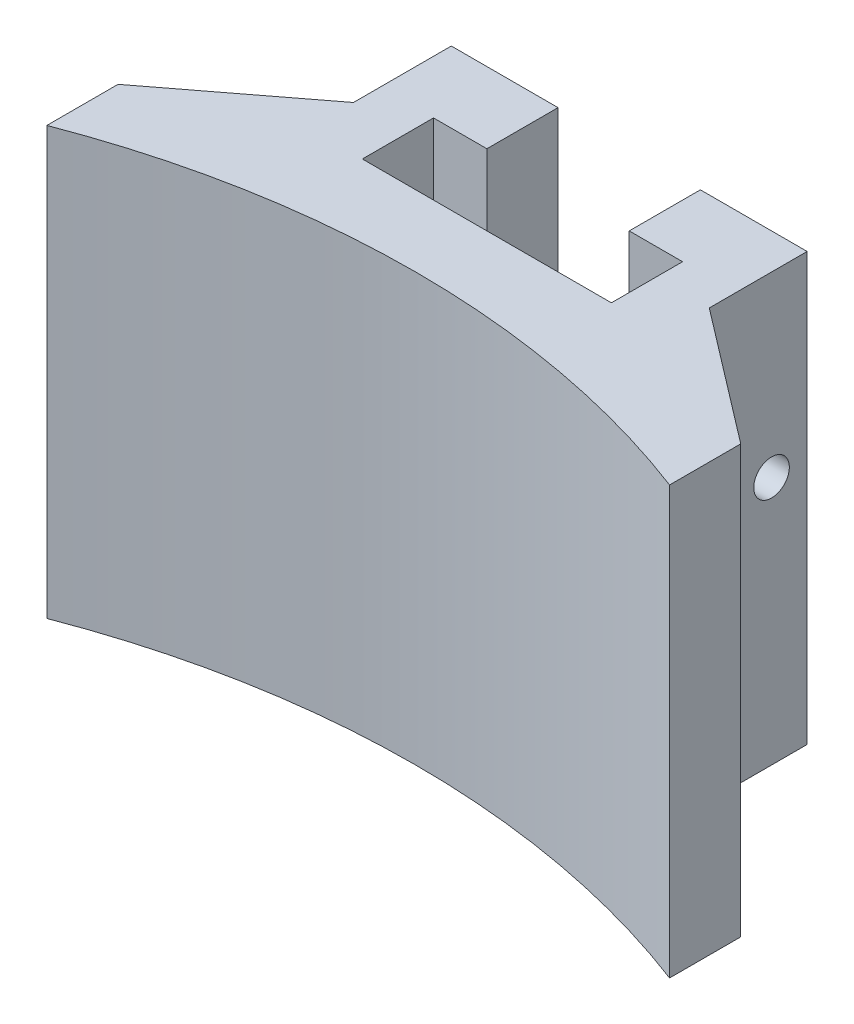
ISO-10303-21;
HEADER;
FILE_DESCRIPTION(('STEP AP214'),'2;1');
FILE_NAME('part.step','',(''),(''),'','','');
FILE_SCHEMA(('AUTOMOTIVE_DESIGN { 1 0 10303 214 1 1 1 1 }'));
ENDSEC;
DATA;
#1=APPLICATION_CONTEXT('core data for automotive mechanical design processes');
#2=APPLICATION_PROTOCOL_DEFINITION('international standard','automotive_design',2000,#1);
#3=PRODUCT_CONTEXT('',#1,'mechanical');
#4=PRODUCT('Part','Part','',(#3));
#5=PRODUCT_RELATED_PRODUCT_CATEGORY('part','',(#4));
#6=PRODUCT_DEFINITION_FORMATION('','',#4);
#7=PRODUCT_DEFINITION_CONTEXT('part definition',#1,'design');
#8=PRODUCT_DEFINITION('design','',#6,#7);
#9=PRODUCT_DEFINITION_SHAPE('','',#8);
#10=(LENGTH_UNIT() NAMED_UNIT(*) SI_UNIT(.MILLI.,.METRE.));
#11=(NAMED_UNIT(*) PLANE_ANGLE_UNIT() SI_UNIT($,.RADIAN.));
#12=(NAMED_UNIT(*) SI_UNIT($,.STERADIAN.) SOLID_ANGLE_UNIT());
#13=UNCERTAINTY_MEASURE_WITH_UNIT(LENGTH_MEASURE(1.E-05),#10,'distance_accuracy_value','');
#14=(GEOMETRIC_REPRESENTATION_CONTEXT(3) GLOBAL_UNCERTAINTY_ASSIGNED_CONTEXT((#13)) GLOBAL_UNIT_ASSIGNED_CONTEXT((#10,
#11,#12)) REPRESENTATION_CONTEXT('',''));
#15=CARTESIAN_POINT('',(0.,0.,0.));
#16=DIRECTION('',(0.,0.,1.));
#17=DIRECTION('',(1.,0.,0.));
#18=AXIS2_PLACEMENT_3D('',#15,#16,#17);
#19=CARTESIAN_POINT('',(-10.,-12.,11.));
#20=DIRECTION('',(-1.,0.,0.));
#21=DIRECTION('',(0.,0.,1.));
#22=AXIS2_PLACEMENT_3D('',#19,#20,#21);
#23=PLANE('',#22);
#24=DIRECTION('',(0.,-1.,0.));
#25=VECTOR('',#24,1.);
#26=CARTESIAN_POINT('',(-10.,48.3277205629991,5.5));
#27=LINE('',#26,#25);
#28=CARTESIAN_POINT('',(-10.,12.,5.5));
#29=VERTEX_POINT('',#28);
#30=CARTESIAN_POINT('',(-10.,-12.,5.5));
#31=VERTEX_POINT('',#30);
#32=EDGE_CURVE('E154',#29,#31,#27,.T.);
#33=ORIENTED_EDGE('',*,*,#32,.F.);
#34=DIRECTION('',(0.,0.,-1.));
#35=VECTOR('',#34,1.);
#36=CARTESIAN_POINT('',(-10.,12.,11.));
#37=LINE('',#36,#35);
#38=CARTESIAN_POINT('',(-10.,12.,0.));
#39=VERTEX_POINT('',#38);
#40=EDGE_CURVE('E152',#29,#39,#37,.T.);
#41=ORIENTED_EDGE('',*,*,#40,.T.);
#42=DIRECTION('',(0.,1.,0.));
#43=VECTOR('',#42,1.);
#44=CARTESIAN_POINT('',(-10.,-12.,0.));
#45=LINE('',#44,#43);
#46=CARTESIAN_POINT('',(-10.,-12.,0.));
#47=VERTEX_POINT('',#46);
#48=EDGE_CURVE('E247',#47,#39,#45,.T.);
#49=ORIENTED_EDGE('',*,*,#48,.F.);
#50=DIRECTION('',(0.,0.,-1.));
#51=VECTOR('',#50,1.);
#52=CARTESIAN_POINT('',(-10.,-12.,11.));
#53=LINE('',#52,#51);
#54=EDGE_CURVE('E11',#31,#47,#53,.T.);
#55=ORIENTED_EDGE('',*,*,#54,.F.);
#56=EDGE_LOOP('',(#33,#41,#49,#55));
#57=FACE_BOUND('',#56,.T.);
#58=CARTESIAN_POINT('',(-10.,2.,2.));
#59=DIRECTION('',(-1.,0.,0.));
#60=DIRECTION('',(0.,0.,1.));
#61=AXIS2_PLACEMENT_3D('',#58,#59,#60);
#62=CIRCLE('',#61,1.);
#63=CARTESIAN_POINT('',(-10.,2.,3.));
#64=VERTEX_POINT('',#63);
#65=EDGE_CURVE('E192',#64,#64,#62,.T.);
#66=ORIENTED_EDGE('',*,*,#65,.F.);
#67=EDGE_LOOP('',(#66));
#68=FACE_BOUND('',#67,.T.);
#69=ADVANCED_FACE('F33',(#57,#68),#23,.T.);
#70=CARTESIAN_POINT('',(-10.,-12.,11.));
#71=DIRECTION('',(0.,1.,0.));
#72=DIRECTION('',(0.,0.,1.));
#73=AXIS2_PLACEMENT_3D('',#70,#71,#72);
#74=PLANE('',#73);
#75=DIRECTION('',(0.794548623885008,0.,-0.607200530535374));
#76=VECTOR('',#75,1.);
#77=CARTESIAN_POINT('',(-17.5,-12.,11.2315610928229));
#78=LINE('',#77,#76);
#79=CARTESIAN_POINT('',(-17.5,-12.,11.2315610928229));
#80=VERTEX_POINT('',#79);
#81=EDGE_CURVE('E160',#80,#31,#78,.T.);
#82=ORIENTED_EDGE('',*,*,#81,.T.);
#83=ORIENTED_EDGE('',*,*,#54,.T.);
#84=DIRECTION('',(1.,0.,0.));
#85=VECTOR('',#84,1.);
#86=CARTESIAN_POINT('',(-10.,-12.,0.));
#87=LINE('',#86,#85);
#88=CARTESIAN_POINT('',(10.,-12.,0.));
#89=VERTEX_POINT('',#88);
#90=EDGE_CURVE('E271',#47,#89,#87,.T.);
#91=ORIENTED_EDGE('',*,*,#90,.T.);
#92=DIRECTION('',(0.,0.,-1.));
#93=VECTOR('',#92,1.);
#94=CARTESIAN_POINT('',(10.,-12.,11.));
#95=LINE('',#94,#93);
#96=CARTESIAN_POINT('',(10.,-12.,5.5));
#97=VERTEX_POINT('',#96);
#98=EDGE_CURVE('E41',#97,#89,#95,.T.);
#99=ORIENTED_EDGE('',*,*,#98,.F.);
#100=DIRECTION('',(0.794548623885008,0.,0.607200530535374));
#101=VECTOR('',#100,1.);
#102=CARTESIAN_POINT('',(17.5,-12.,11.2315610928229));
#103=LINE('',#102,#101);
#104=CARTESIAN_POINT('',(17.5,-12.,11.2315610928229));
#105=VERTEX_POINT('',#104);
#106=EDGE_CURVE('E171',#97,#105,#103,.T.);
#107=ORIENTED_EDGE('',*,*,#106,.T.);
#108=DIRECTION('',(0.,0.,1.));
#109=VECTOR('',#108,1.);
#110=CARTESIAN_POINT('',(17.5,-12.,15.2315610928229));
#111=LINE('',#110,#109);
#112=CARTESIAN_POINT('',(17.5,-12.,15.2315610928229));
#113=VERTEX_POINT('',#112);
#114=EDGE_CURVE('E168',#105,#113,#111,.T.);
#115=ORIENTED_EDGE('',*,*,#114,.T.);
#116=CARTESIAN_POINT('',(0.,-12.,61.));
#117=DIRECTION('',(0.,1.,0.));
#118=DIRECTION('',(0.,0.,-1.));
#119=AXIS2_PLACEMENT_3D('',#116,#117,#118);
#120=CIRCLE('',#119,49.);
#121=CARTESIAN_POINT('',(-17.5,-12.,15.2315610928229));
#122=VERTEX_POINT('',#121);
#123=EDGE_CURVE('E175',#113,#122,#120,.T.);
#124=ORIENTED_EDGE('',*,*,#123,.T.);
#125=DIRECTION('',(0.,0.,-1.));
#126=VECTOR('',#125,1.);
#127=CARTESIAN_POINT('',(-17.5,-12.,15.2315610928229));
#128=LINE('',#127,#126);
#129=EDGE_CURVE('E290',#122,#80,#128,.T.);
#130=ORIENTED_EDGE('',*,*,#129,.T.);
#131=EDGE_LOOP('',(#82,#83,#91,#99,#107,#115,#124,#130));
#132=FACE_BOUND('',#131,.T.);
#133=ADVANCED_FACE('F286',(#132),#74,.F.);
#134=CARTESIAN_POINT('',(10.,-12.,11.));
#135=DIRECTION('',(-1.,0.,0.));
#136=DIRECTION('',(0.,0.,1.));
#137=AXIS2_PLACEMENT_3D('',#134,#135,#136);
#138=PLANE('',#137);
#139=CARTESIAN_POINT('',(10.,2.,2.));
#140=DIRECTION('',(-1.,0.,0.));
#141=DIRECTION('',(0.,0.,1.));
#142=AXIS2_PLACEMENT_3D('',#139,#140,#141);
#143=CIRCLE('',#142,1.);
#144=CARTESIAN_POINT('',(10.,2.,3.));
#145=VERTEX_POINT('',#144);
#146=EDGE_CURVE('E193',#145,#145,#143,.T.);
#147=ORIENTED_EDGE('',*,*,#146,.T.);
#148=EDGE_LOOP('',(#147));
#149=FACE_BOUND('',#148,.T.);
#150=DIRECTION('',(0.,0.,-1.));
#151=VECTOR('',#150,1.);
#152=CARTESIAN_POINT('',(10.,12.,11.));
#153=LINE('',#152,#151);
#154=CARTESIAN_POINT('',(10.,12.,5.5));
#155=VERTEX_POINT('',#154);
#156=CARTESIAN_POINT('',(10.,12.,0.));
#157=VERTEX_POINT('',#156);
#158=EDGE_CURVE('E275',#155,#157,#153,.T.);
#159=ORIENTED_EDGE('',*,*,#158,.F.);
#160=DIRECTION('',(0.,-1.,0.));
#161=VECTOR('',#160,1.);
#162=CARTESIAN_POINT('',(10.,48.3277205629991,5.5));
#163=LINE('',#162,#161);
#164=EDGE_CURVE('E55',#155,#97,#163,.T.);
#165=ORIENTED_EDGE('',*,*,#164,.T.);
#166=ORIENTED_EDGE('',*,*,#98,.T.);
#167=DIRECTION('',(0.,1.,0.));
#168=VECTOR('',#167,1.);
#169=CARTESIAN_POINT('',(10.,-12.,0.));
#170=LINE('',#169,#168);
#171=EDGE_CURVE('E268',#89,#157,#170,.T.);
#172=ORIENTED_EDGE('',*,*,#171,.T.);
#173=EDGE_LOOP('',(#159,#165,#166,#172));
#174=FACE_BOUND('',#173,.T.);
#175=ADVANCED_FACE('F318',(#149,#174),#138,.F.);
#176=CARTESIAN_POINT('',(-10.,12.,11.));
#177=DIRECTION('',(0.,1.,0.));
#178=DIRECTION('',(0.,0.,1.));
#179=AXIS2_PLACEMENT_3D('',#176,#177,#178);
#180=PLANE('',#179);
#181=ORIENTED_EDGE('',*,*,#40,.F.);
#182=DIRECTION('',(0.794548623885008,0.,-0.607200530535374));
#183=VECTOR('',#182,1.);
#184=CARTESIAN_POINT('',(-17.5,12.,11.2315610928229));
#185=LINE('',#184,#183);
#186=CARTESIAN_POINT('',(-17.5,12.,11.2315610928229));
#187=VERTEX_POINT('',#186);
#188=EDGE_CURVE('E145',#187,#29,#185,.T.);
#189=ORIENTED_EDGE('',*,*,#188,.F.);
#190=DIRECTION('',(0.,0.,-1.));
#191=VECTOR('',#190,1.);
#192=CARTESIAN_POINT('',(-17.5,12.,15.2315610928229));
#193=LINE('',#192,#191);
#194=CARTESIAN_POINT('',(-17.5,12.,15.2315610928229));
#195=VERTEX_POINT('',#194);
#196=EDGE_CURVE('E149',#195,#187,#193,.T.);
#197=ORIENTED_EDGE('',*,*,#196,.F.);
#198=CARTESIAN_POINT('',(0.,12.,61.));
#199=DIRECTION('',(0.,1.,0.));
#200=DIRECTION('',(0.,0.,1.));
#201=AXIS2_PLACEMENT_3D('',#198,#199,#200);
#202=CIRCLE('',#201,49.);
#203=CARTESIAN_POINT('',(17.5,12.,15.2315610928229));
#204=VERTEX_POINT('',#203);
#205=EDGE_CURVE('E177',#204,#195,#202,.T.);
#206=ORIENTED_EDGE('',*,*,#205,.F.);
#207=DIRECTION('',(0.,0.,1.));
#208=VECTOR('',#207,1.);
#209=CARTESIAN_POINT('',(17.5,12.,15.2315610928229));
#210=LINE('',#209,#208);
#211=CARTESIAN_POINT('',(17.5,12.,11.2315610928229));
#212=VERTEX_POINT('',#211);
#213=EDGE_CURVE('E180',#212,#204,#210,.T.);
#214=ORIENTED_EDGE('',*,*,#213,.F.);
#215=DIRECTION('',(0.794548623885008,0.,0.607200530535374));
#216=VECTOR('',#215,1.);
#217=CARTESIAN_POINT('',(17.5,12.,11.2315610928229));
#218=LINE('',#217,#216);
#219=EDGE_CURVE('E184',#155,#212,#218,.T.);
#220=ORIENTED_EDGE('',*,*,#219,.F.);
#221=ORIENTED_EDGE('',*,*,#158,.T.);
#222=DIRECTION('',(1.,0.,0.));
#223=VECTOR('',#222,1.);
#224=CARTESIAN_POINT('',(-10.,12.,0.));
#225=LINE('',#224,#223);
#226=CARTESIAN_POINT('',(4.,12.,0.));
#227=VERTEX_POINT('',#226);
#228=EDGE_CURVE('E264',#227,#157,#225,.T.);
#229=ORIENTED_EDGE('',*,*,#228,.F.);
#230=DIRECTION('',(0.,0.,-1.));
#231=VECTOR('',#230,1.);
#232=CARTESIAN_POINT('',(4.,12.,0.));
#233=LINE('',#232,#231);
#234=CARTESIAN_POINT('',(4.,12.,4.));
#235=VERTEX_POINT('',#234);
#236=EDGE_CURVE('E201',#235,#227,#233,.T.);
#237=ORIENTED_EDGE('',*,*,#236,.F.);
#238=DIRECTION('',(-1.,0.,0.));
#239=VECTOR('',#238,1.);
#240=CARTESIAN_POINT('',(7.,12.,4.));
#241=LINE('',#240,#239);
#242=CARTESIAN_POINT('',(7.,12.,4.));
#243=VERTEX_POINT('',#242);
#244=EDGE_CURVE('E205',#243,#235,#241,.T.);
#245=ORIENTED_EDGE('',*,*,#244,.F.);
#246=DIRECTION('',(0.,0.,-1.));
#247=VECTOR('',#246,1.);
#248=CARTESIAN_POINT('',(7.,12.,8.));
#249=LINE('',#248,#247);
#250=CARTESIAN_POINT('',(7.,12.,8.));
#251=VERTEX_POINT('',#250);
#252=EDGE_CURVE('E240',#251,#243,#249,.T.);
#253=ORIENTED_EDGE('',*,*,#252,.F.);
#254=DIRECTION('',(1.,0.,0.));
#255=VECTOR('',#254,1.);
#256=CARTESIAN_POINT('',(-7.,12.,8.));
#257=LINE('',#256,#255);
#258=CARTESIAN_POINT('',(-7.,12.,8.));
#259=VERTEX_POINT('',#258);
#260=EDGE_CURVE('E237',#259,#251,#257,.T.);
#261=ORIENTED_EDGE('',*,*,#260,.F.);
#262=DIRECTION('',(0.,0.,1.));
#263=VECTOR('',#262,1.);
#264=CARTESIAN_POINT('',(-7.,12.,4.));
#265=LINE('',#264,#263);
#266=CARTESIAN_POINT('',(-7.,12.,4.));
#267=VERTEX_POINT('',#266);
#268=EDGE_CURVE('E234',#267,#259,#265,.T.);
#269=ORIENTED_EDGE('',*,*,#268,.F.);
#270=DIRECTION('',(-1.,0.,0.));
#271=VECTOR('',#270,1.);
#272=CARTESIAN_POINT('',(-4.,12.,4.));
#273=LINE('',#272,#271);
#274=CARTESIAN_POINT('',(-4.,12.,4.));
#275=VERTEX_POINT('',#274);
#276=EDGE_CURVE('E231',#275,#267,#273,.T.);
#277=ORIENTED_EDGE('',*,*,#276,.F.);
#278=DIRECTION('',(0.,0.,1.));
#279=VECTOR('',#278,1.);
#280=CARTESIAN_POINT('',(-4.,12.,4.));
#281=LINE('',#280,#279);
#282=CARTESIAN_POINT('',(-4.,12.,0.));
#283=VERTEX_POINT('',#282);
#284=EDGE_CURVE('E228',#283,#275,#281,.T.);
#285=ORIENTED_EDGE('',*,*,#284,.F.);
#286=EDGE_CURVE('E265',#39,#283,#225,.T.);
#287=ORIENTED_EDGE('',*,*,#286,.F.);
#288=EDGE_LOOP('',(#181,#189,#197,#206,#214,#220,#221,#229,#237,#245,#253,#261,#269,#277,#285,#287));
#289=FACE_BOUND('',#288,.T.);
#290=ADVANCED_FACE('F147',(#289),#180,.T.);
#291=CARTESIAN_POINT('',(0.,0.,0.));
#292=DIRECTION('',(0.,0.,-1.));
#293=DIRECTION('',(-1.,0.,0.));
#294=AXIS2_PLACEMENT_3D('',#291,#292,#293);
#295=PLANE('',#294);
#296=DIRECTION('',(0.,1.,0.));
#297=VECTOR('',#296,1.);
#298=CARTESIAN_POINT('',(4.,-8.,0.));
#299=LINE('',#298,#297);
#300=CARTESIAN_POINT('',(4.,-8.,0.));
#301=VERTEX_POINT('',#300);
#302=EDGE_CURVE('E226',#301,#227,#299,.T.);
#303=ORIENTED_EDGE('',*,*,#302,.T.);
#304=ORIENTED_EDGE('',*,*,#228,.T.);
#305=ORIENTED_EDGE('',*,*,#171,.F.);
#306=ORIENTED_EDGE('',*,*,#90,.F.);
#307=ORIENTED_EDGE('',*,*,#48,.T.);
#308=ORIENTED_EDGE('',*,*,#286,.T.);
#309=DIRECTION('',(0.,1.,0.));
#310=VECTOR('',#309,1.);
#311=CARTESIAN_POINT('',(-4.,-8.,0.));
#312=LINE('',#311,#310);
#313=CARTESIAN_POINT('',(-4.,-8.,0.));
#314=VERTEX_POINT('',#313);
#315=EDGE_CURVE('E258',#314,#283,#312,.T.);
#316=ORIENTED_EDGE('',*,*,#315,.F.);
#317=DIRECTION('',(-1.,0.,0.));
#318=VECTOR('',#317,1.);
#319=CARTESIAN_POINT('',(-4.,-8.,0.));
#320=LINE('',#319,#318);
#321=EDGE_CURVE('E204',#301,#314,#320,.T.);
#322=ORIENTED_EDGE('',*,*,#321,.F.);
#323=EDGE_LOOP('',(#303,#304,#305,#306,#307,#308,#316,#322));
#324=FACE_BOUND('',#323,.T.);
#325=ADVANCED_FACE('F282',(#324),#295,.T.);
#326=CARTESIAN_POINT('',(4.,-8.,0.));
#327=DIRECTION('',(1.,0.,0.));
#328=DIRECTION('',(0.,0.,-1.));
#329=AXIS2_PLACEMENT_3D('',#326,#327,#328);
#330=PLANE('',#329);
#331=CARTESIAN_POINT('',(4.,2.,2.));
#332=DIRECTION('',(1.,0.,0.));
#333=DIRECTION('',(0.,0.,-1.));
#334=AXIS2_PLACEMENT_3D('',#331,#332,#333);
#335=CIRCLE('',#334,1.);
#336=CARTESIAN_POINT('',(4.,2.,1.));
#337=VERTEX_POINT('',#336);
#338=EDGE_CURVE('E198',#337,#337,#335,.T.);
#339=ORIENTED_EDGE('',*,*,#338,.T.);
#340=EDGE_LOOP('',(#339));
#341=FACE_BOUND('',#340,.T.);
#342=ORIENTED_EDGE('',*,*,#236,.T.);
#343=ORIENTED_EDGE('',*,*,#302,.F.);
#344=DIRECTION('',(0.,0.,-1.));
#345=VECTOR('',#344,1.);
#346=CARTESIAN_POINT('',(4.,-8.,0.));
#347=LINE('',#346,#345);
#348=CARTESIAN_POINT('',(4.,-8.,4.));
#349=VERTEX_POINT('',#348);
#350=EDGE_CURVE('E202',#349,#301,#347,.T.);
#351=ORIENTED_EDGE('',*,*,#350,.F.);
#352=DIRECTION('',(0.,1.,0.));
#353=VECTOR('',#352,1.);
#354=CARTESIAN_POINT('',(4.,-8.,4.));
#355=LINE('',#354,#353);
#356=EDGE_CURVE('E245',#349,#235,#355,.T.);
#357=ORIENTED_EDGE('',*,*,#356,.T.);
#358=EDGE_LOOP('',(#342,#343,#351,#357));
#359=FACE_BOUND('',#358,.T.);
#360=ADVANCED_FACE('F332',(#341,#359),#330,.F.);
#361=CARTESIAN_POINT('',(7.,-8.,4.));
#362=DIRECTION('',(0.,0.,-1.));
#363=DIRECTION('',(-1.,0.,0.));
#364=AXIS2_PLACEMENT_3D('',#361,#362,#363);
#365=PLANE('',#364);
#366=ORIENTED_EDGE('',*,*,#244,.T.);
#367=ORIENTED_EDGE('',*,*,#356,.F.);
#368=DIRECTION('',(-1.,0.,0.));
#369=VECTOR('',#368,1.);
#370=CARTESIAN_POINT('',(7.,-8.,4.));
#371=LINE('',#370,#369);
#372=CARTESIAN_POINT('',(7.,-8.,4.));
#373=VERTEX_POINT('',#372);
#374=EDGE_CURVE('E223',#373,#349,#371,.T.);
#375=ORIENTED_EDGE('',*,*,#374,.F.);
#376=DIRECTION('',(0.,1.,0.));
#377=VECTOR('',#376,1.);
#378=CARTESIAN_POINT('',(7.,-8.,4.));
#379=LINE('',#378,#377);
#380=EDGE_CURVE('E248',#373,#243,#379,.T.);
#381=ORIENTED_EDGE('',*,*,#380,.T.);
#382=EDGE_LOOP('',(#366,#367,#375,#381));
#383=FACE_BOUND('',#382,.T.);
#384=ADVANCED_FACE('F337',(#383),#365,.F.);
#385=CARTESIAN_POINT('',(7.,-8.,8.));
#386=DIRECTION('',(1.,0.,0.));
#387=DIRECTION('',(0.,0.,-1.));
#388=AXIS2_PLACEMENT_3D('',#385,#386,#387);
#389=PLANE('',#388);
#390=ORIENTED_EDGE('',*,*,#252,.T.);
#391=ORIENTED_EDGE('',*,*,#380,.F.);
#392=DIRECTION('',(0.,0.,-1.));
#393=VECTOR('',#392,1.);
#394=CARTESIAN_POINT('',(7.,-8.,8.));
#395=LINE('',#394,#393);
#396=CARTESIAN_POINT('',(7.,-8.,8.));
#397=VERTEX_POINT('',#396);
#398=EDGE_CURVE('E220',#397,#373,#395,.T.);
#399=ORIENTED_EDGE('',*,*,#398,.F.);
#400=DIRECTION('',(0.,1.,0.));
#401=VECTOR('',#400,1.);
#402=CARTESIAN_POINT('',(7.,-8.,8.));
#403=LINE('',#402,#401);
#404=EDGE_CURVE('E250',#397,#251,#403,.T.);
#405=ORIENTED_EDGE('',*,*,#404,.T.);
#406=EDGE_LOOP('',(#390,#391,#399,#405));
#407=FACE_BOUND('',#406,.T.);
#408=ADVANCED_FACE('F342',(#407),#389,.F.);
#409=CARTESIAN_POINT('',(-7.,-8.,8.));
#410=DIRECTION('',(0.,0.,1.));
#411=DIRECTION('',(1.,0.,0.));
#412=AXIS2_PLACEMENT_3D('',#409,#410,#411);
#413=PLANE('',#412);
#414=ORIENTED_EDGE('',*,*,#260,.T.);
#415=ORIENTED_EDGE('',*,*,#404,.F.);
#416=DIRECTION('',(1.,0.,0.));
#417=VECTOR('',#416,1.);
#418=CARTESIAN_POINT('',(-7.,-8.,8.));
#419=LINE('',#418,#417);
#420=CARTESIAN_POINT('',(-7.,-8.,8.));
#421=VERTEX_POINT('',#420);
#422=EDGE_CURVE('E217',#421,#397,#419,.T.);
#423=ORIENTED_EDGE('',*,*,#422,.F.);
#424=DIRECTION('',(0.,1.,0.));
#425=VECTOR('',#424,1.);
#426=CARTESIAN_POINT('',(-7.,-8.,8.));
#427=LINE('',#426,#425);
#428=EDGE_CURVE('E252',#421,#259,#427,.T.);
#429=ORIENTED_EDGE('',*,*,#428,.T.);
#430=EDGE_LOOP('',(#414,#415,#423,#429));
#431=FACE_BOUND('',#430,.T.);
#432=ADVANCED_FACE('F359',(#431),#413,.F.);
#433=CARTESIAN_POINT('',(-7.,-8.,4.));
#434=DIRECTION('',(-1.,0.,0.));
#435=DIRECTION('',(0.,0.,1.));
#436=AXIS2_PLACEMENT_3D('',#433,#434,#435);
#437=PLANE('',#436);
#438=ORIENTED_EDGE('',*,*,#268,.T.);
#439=ORIENTED_EDGE('',*,*,#428,.F.);
#440=DIRECTION('',(0.,0.,1.));
#441=VECTOR('',#440,1.);
#442=CARTESIAN_POINT('',(-7.,-8.,4.));
#443=LINE('',#442,#441);
#444=CARTESIAN_POINT('',(-7.,-8.,4.));
#445=VERTEX_POINT('',#444);
#446=EDGE_CURVE('E214',#445,#421,#443,.T.);
#447=ORIENTED_EDGE('',*,*,#446,.F.);
#448=DIRECTION('',(0.,1.,0.));
#449=VECTOR('',#448,1.);
#450=CARTESIAN_POINT('',(-7.,-8.,4.));
#451=LINE('',#450,#449);
#452=EDGE_CURVE('E254',#445,#267,#451,.T.);
#453=ORIENTED_EDGE('',*,*,#452,.T.);
#454=EDGE_LOOP('',(#438,#439,#447,#453));
#455=FACE_BOUND('',#454,.T.);
#456=ADVANCED_FACE('F355',(#455),#437,.F.);
#457=CARTESIAN_POINT('',(-4.,-8.,4.));
#458=DIRECTION('',(0.,0.,-1.));
#459=DIRECTION('',(-1.,0.,0.));
#460=AXIS2_PLACEMENT_3D('',#457,#458,#459);
#461=PLANE('',#460);
#462=ORIENTED_EDGE('',*,*,#276,.T.);
#463=ORIENTED_EDGE('',*,*,#452,.F.);
#464=DIRECTION('',(-1.,0.,0.));
#465=VECTOR('',#464,1.);
#466=CARTESIAN_POINT('',(-4.,-8.,4.));
#467=LINE('',#466,#465);
#468=CARTESIAN_POINT('',(-4.,-8.,4.));
#469=VERTEX_POINT('',#468);
#470=EDGE_CURVE('E211',#469,#445,#467,.T.);
#471=ORIENTED_EDGE('',*,*,#470,.F.);
#472=DIRECTION('',(0.,1.,0.));
#473=VECTOR('',#472,1.);
#474=CARTESIAN_POINT('',(-4.,-8.,4.));
#475=LINE('',#474,#473);
#476=EDGE_CURVE('E256',#469,#275,#475,.T.);
#477=ORIENTED_EDGE('',*,*,#476,.T.);
#478=EDGE_LOOP('',(#462,#463,#471,#477));
#479=FACE_BOUND('',#478,.T.);
#480=ADVANCED_FACE('F351',(#479),#461,.F.);
#481=CARTESIAN_POINT('',(-4.,-8.,4.));
#482=DIRECTION('',(-1.,0.,0.));
#483=DIRECTION('',(0.,0.,1.));
#484=AXIS2_PLACEMENT_3D('',#481,#482,#483);
#485=PLANE('',#484);
#486=CARTESIAN_POINT('',(-4.,2.,2.));
#487=DIRECTION('',(-1.,0.,0.));
#488=DIRECTION('',(0.,0.,1.));
#489=AXIS2_PLACEMENT_3D('',#486,#487,#488);
#490=CIRCLE('',#489,1.);
#491=CARTESIAN_POINT('',(-4.,2.,3.));
#492=VERTEX_POINT('',#491);
#493=EDGE_CURVE('E36',#492,#492,#490,.T.);
#494=ORIENTED_EDGE('',*,*,#493,.T.);
#495=EDGE_LOOP('',(#494));
#496=FACE_BOUND('',#495,.T.);
#497=ORIENTED_EDGE('',*,*,#284,.T.);
#498=ORIENTED_EDGE('',*,*,#476,.F.);
#499=DIRECTION('',(0.,0.,1.));
#500=VECTOR('',#499,1.);
#501=CARTESIAN_POINT('',(-4.,-8.,4.));
#502=LINE('',#501,#500);
#503=EDGE_CURVE('E208',#314,#469,#502,.T.);
#504=ORIENTED_EDGE('',*,*,#503,.F.);
#505=ORIENTED_EDGE('',*,*,#315,.T.);
#506=EDGE_LOOP('',(#497,#498,#504,#505));
#507=FACE_BOUND('',#506,.T.);
#508=ADVANCED_FACE('F347',(#496,#507),#485,.F.);
#509=CARTESIAN_POINT('',(0.,-8.,0.));
#510=DIRECTION('',(0.,-1.,0.));
#511=DIRECTION('',(0.,0.,-1.));
#512=AXIS2_PLACEMENT_3D('',#509,#510,#511);
#513=PLANE('',#512);
#514=ORIENTED_EDGE('',*,*,#350,.T.);
#515=ORIENTED_EDGE('',*,*,#321,.T.);
#516=ORIENTED_EDGE('',*,*,#503,.T.);
#517=ORIENTED_EDGE('',*,*,#470,.T.);
#518=ORIENTED_EDGE('',*,*,#446,.T.);
#519=ORIENTED_EDGE('',*,*,#422,.T.);
#520=ORIENTED_EDGE('',*,*,#398,.T.);
#521=ORIENTED_EDGE('',*,*,#374,.T.);
#522=EDGE_LOOP('',(#514,#515,#516,#517,#518,#519,#520,#521));
#523=FACE_BOUND('',#522,.T.);
#524=ADVANCED_FACE('F350',(#523),#513,.F.);
#525=CARTESIAN_POINT('',(10.,2.,2.));
#526=DIRECTION('',(-1.,0.,0.));
#527=DIRECTION('',(0.,0.,1.));
#528=AXIS2_PLACEMENT_3D('',#525,#526,#527);
#529=CYLINDRICAL_SURFACE('',#528,1.);
#530=ORIENTED_EDGE('',*,*,#65,.T.);
#531=EDGE_LOOP('',(#530));
#532=FACE_BOUND('',#531,.T.);
#533=ORIENTED_EDGE('',*,*,#493,.F.);
#534=EDGE_LOOP('',(#533));
#535=FACE_BOUND('',#534,.T.);
#536=ADVANCED_FACE('F369',(#532,#535),#529,.F.);
#537=ORIENTED_EDGE('',*,*,#146,.F.);
#538=EDGE_LOOP('',(#537));
#539=FACE_BOUND('',#538,.T.);
#540=ORIENTED_EDGE('',*,*,#338,.F.);
#541=EDGE_LOOP('',(#540));
#542=FACE_BOUND('',#541,.T.);
#543=ADVANCED_FACE('F371',(#539,#542),#529,.F.);
#544=CARTESIAN_POINT('',(-17.5,48.3277205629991,15.2315610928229));
#545=DIRECTION('',(-1.,0.,0.));
#546=DIRECTION('',(0.,0.,1.));
#547=AXIS2_PLACEMENT_3D('',#544,#545,#546);
#548=PLANE('',#547);
#549=DIRECTION('',(0.,-1.,0.));
#550=VECTOR('',#549,1.);
#551=CARTESIAN_POINT('',(-17.5,48.3277205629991,15.2315610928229));
#552=LINE('',#551,#550);
#553=EDGE_CURVE('E167',#195,#122,#552,.T.);
#554=ORIENTED_EDGE('',*,*,#553,.F.);
#555=ORIENTED_EDGE('',*,*,#196,.T.);
#556=DIRECTION('',(0.,-1.,0.));
#557=VECTOR('',#556,1.);
#558=CARTESIAN_POINT('',(-17.5,48.3277205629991,11.2315610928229));
#559=LINE('',#558,#557);
#560=EDGE_CURVE('E155',#187,#80,#559,.T.);
#561=ORIENTED_EDGE('',*,*,#560,.T.);
#562=ORIENTED_EDGE('',*,*,#129,.F.);
#563=EDGE_LOOP('',(#554,#555,#561,#562));
#564=FACE_BOUND('',#563,.T.);
#565=ADVANCED_FACE('F166',(#564),#548,.T.);
#566=CARTESIAN_POINT('',(-17.5,48.3277205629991,11.2315610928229));
#567=DIRECTION('',(-0.607200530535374,0.,-0.794548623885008));
#568=DIRECTION('',(-0.794548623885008,0.,0.607200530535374));
#569=AXIS2_PLACEMENT_3D('',#566,#567,#568);
#570=PLANE('',#569);
#571=ORIENTED_EDGE('',*,*,#560,.F.);
#572=ORIENTED_EDGE('',*,*,#188,.T.);
#573=ORIENTED_EDGE('',*,*,#32,.T.);
#574=ORIENTED_EDGE('',*,*,#81,.F.);
#575=EDGE_LOOP('',(#571,#572,#573,#574));
#576=FACE_BOUND('',#575,.T.);
#577=ADVANCED_FACE('F158',(#576),#570,.T.);
#578=CARTESIAN_POINT('',(17.5,48.3277205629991,11.2315610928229));
#579=DIRECTION('',(0.607200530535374,0.,-0.794548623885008));
#580=DIRECTION('',(-0.794548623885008,0.,-0.607200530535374));
#581=AXIS2_PLACEMENT_3D('',#578,#579,#580);
#582=PLANE('',#581);
#583=ORIENTED_EDGE('',*,*,#164,.F.);
#584=ORIENTED_EDGE('',*,*,#219,.T.);
#585=DIRECTION('',(0.,-1.,0.));
#586=VECTOR('',#585,1.);
#587=CARTESIAN_POINT('',(17.5,48.3277205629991,11.2315610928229));
#588=LINE('',#587,#586);
#589=EDGE_CURVE('E183',#212,#105,#588,.T.);
#590=ORIENTED_EDGE('',*,*,#589,.T.);
#591=ORIENTED_EDGE('',*,*,#106,.F.);
#592=EDGE_LOOP('',(#583,#584,#590,#591));
#593=FACE_BOUND('',#592,.T.);
#594=ADVANCED_FACE('F303',(#593),#582,.T.);
#595=CARTESIAN_POINT('',(17.5,48.3277205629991,15.2315610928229));
#596=DIRECTION('',(1.,0.,0.));
#597=DIRECTION('',(0.,0.,-1.));
#598=AXIS2_PLACEMENT_3D('',#595,#596,#597);
#599=PLANE('',#598);
#600=ORIENTED_EDGE('',*,*,#589,.F.);
#601=ORIENTED_EDGE('',*,*,#213,.T.);
#602=DIRECTION('',(0.,-1.,0.));
#603=VECTOR('',#602,1.);
#604=CARTESIAN_POINT('',(17.5,48.3277205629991,15.2315610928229));
#605=LINE('',#604,#603);
#606=EDGE_CURVE('E179',#204,#113,#605,.T.);
#607=ORIENTED_EDGE('',*,*,#606,.T.);
#608=ORIENTED_EDGE('',*,*,#114,.F.);
#609=EDGE_LOOP('',(#600,#601,#607,#608));
#610=FACE_BOUND('',#609,.T.);
#611=ADVANCED_FACE('F301',(#610),#599,.T.);
#612=CARTESIAN_POINT('',(0.,48.3277205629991,61.));
#613=DIRECTION('',(0.,-1.,0.));
#614=DIRECTION('',(0.,0.,-1.));
#615=AXIS2_PLACEMENT_3D('',#612,#613,#614);
#616=CYLINDRICAL_SURFACE('',#615,49.);
#617=ORIENTED_EDGE('',*,*,#606,.F.);
#618=ORIENTED_EDGE('',*,*,#205,.T.);
#619=ORIENTED_EDGE('',*,*,#553,.T.);
#620=ORIENTED_EDGE('',*,*,#123,.F.);
#621=EDGE_LOOP('',(#617,#618,#619,#620));
#622=FACE_BOUND('',#621,.T.);
#623=ADVANCED_FACE('F297',(#622),#616,.F.);
#624=CLOSED_SHELL('',(#69,#133,#175,#290,#325,#360,#384,#408,#432,#456,#480,#508,#524,#536,#543,
#565,#577,#594,#611,#623));
#625=MANIFOLD_SOLID_BREP('B2',#624);
#626=ADVANCED_BREP_SHAPE_REPRESENTATION('',(#18,#625),#14);
#627=SHAPE_DEFINITION_REPRESENTATION(#9,#626);
ENDSEC;
END-ISO-10303-21;
